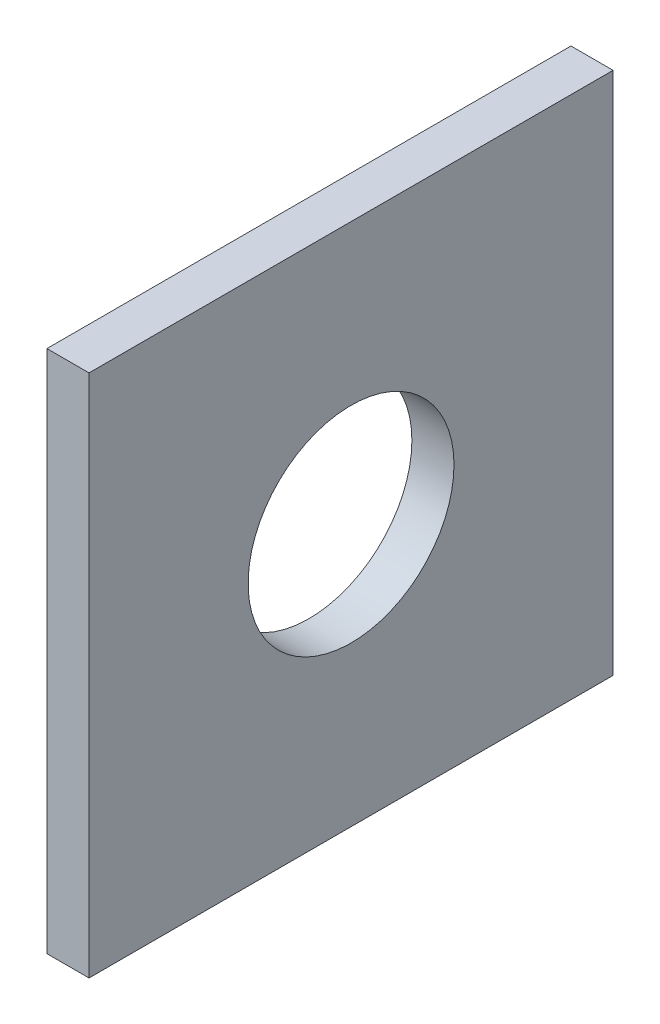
ISO-10303-21;
HEADER;
FILE_DESCRIPTION(('STEP AP214'),'2;1');
FILE_NAME('part.step','',(''),(''),'','','');
FILE_SCHEMA(('AUTOMOTIVE_DESIGN { 1 0 10303 214 1 1 1 1 }'));
ENDSEC;
DATA;
#1=APPLICATION_CONTEXT('core data for automotive mechanical design processes');
#2=APPLICATION_PROTOCOL_DEFINITION('international standard','automotive_design',2000,#1);
#3=PRODUCT_CONTEXT('',#1,'mechanical');
#4=PRODUCT('Part','Part','',(#3));
#5=PRODUCT_RELATED_PRODUCT_CATEGORY('part','',(#4));
#6=PRODUCT_DEFINITION_FORMATION('','',#4);
#7=PRODUCT_DEFINITION_CONTEXT('part definition',#1,'design');
#8=PRODUCT_DEFINITION('design','',#6,#7);
#9=PRODUCT_DEFINITION_SHAPE('','',#8);
#10=(LENGTH_UNIT() NAMED_UNIT(*) SI_UNIT(.MILLI.,.METRE.));
#11=(NAMED_UNIT(*) PLANE_ANGLE_UNIT() SI_UNIT($,.RADIAN.));
#12=(NAMED_UNIT(*) SI_UNIT($,.STERADIAN.) SOLID_ANGLE_UNIT());
#13=UNCERTAINTY_MEASURE_WITH_UNIT(LENGTH_MEASURE(1.E-05),#10,'distance_accuracy_value','');
#14=(GEOMETRIC_REPRESENTATION_CONTEXT(3) GLOBAL_UNCERTAINTY_ASSIGNED_CONTEXT((#13)) GLOBAL_UNIT_ASSIGNED_CONTEXT((#10,
#11,#12)) REPRESENTATION_CONTEXT('',''));
#15=CARTESIAN_POINT('',(0.,0.,0.));
#16=DIRECTION('',(0.,0.,1.));
#17=DIRECTION('',(1.,0.,0.));
#18=AXIS2_PLACEMENT_3D('',#15,#16,#17);
#19=CARTESIAN_POINT('',(-4.5,-28.,28.));
#20=DIRECTION('',(0.,0.,1.));
#21=DIRECTION('',(0.,-1.,0.));
#22=AXIS2_PLACEMENT_3D('',#19,#20,#21);
#23=PLANE('',#22);
#24=DIRECTION('',(0.,-1.,0.));
#25=VECTOR('',#24,1.);
#26=CARTESIAN_POINT('',(0.,-28.,28.));
#27=LINE('',#26,#25);
#28=CARTESIAN_POINT('',(0.,28.,28.));
#29=VERTEX_POINT('',#28);
#30=CARTESIAN_POINT('',(0.,-28.,28.));
#31=VERTEX_POINT('',#30);
#32=EDGE_CURVE('E104',#29,#31,#27,.T.);
#33=ORIENTED_EDGE('',*,*,#32,.F.);
#34=DIRECTION('',(1.,0.,0.));
#35=VECTOR('',#34,1.);
#36=CARTESIAN_POINT('',(-4.5,28.,28.));
#37=LINE('',#36,#35);
#38=CARTESIAN_POINT('',(-4.5,28.,28.));
#39=VERTEX_POINT('',#38);
#40=EDGE_CURVE('E11',#39,#29,#37,.T.);
#41=ORIENTED_EDGE('',*,*,#40,.F.);
#42=DIRECTION('',(0.,-1.,0.));
#43=VECTOR('',#42,1.);
#44=CARTESIAN_POINT('',(-4.5,-28.,28.));
#45=LINE('',#44,#43);
#46=CARTESIAN_POINT('',(-4.5,-28.,28.));
#47=VERTEX_POINT('',#46);
#48=EDGE_CURVE('E97',#39,#47,#45,.T.);
#49=ORIENTED_EDGE('',*,*,#48,.T.);
#50=DIRECTION('',(1.,0.,0.));
#51=VECTOR('',#50,1.);
#52=CARTESIAN_POINT('',(-4.5,-28.,28.));
#53=LINE('',#52,#51);
#54=EDGE_CURVE('E42',#47,#31,#53,.T.);
#55=ORIENTED_EDGE('',*,*,#54,.T.);
#56=EDGE_LOOP('',(#33,#41,#49,#55));
#57=FACE_BOUND('',#56,.T.);
#58=ADVANCED_FACE('F39',(#57),#23,.T.);
#59=CARTESIAN_POINT('',(-4.5,28.,28.));
#60=DIRECTION('',(0.,1.,0.));
#61=DIRECTION('',(0.,0.,1.));
#62=AXIS2_PLACEMENT_3D('',#59,#60,#61);
#63=PLANE('',#62);
#64=DIRECTION('',(0.,0.,1.));
#65=VECTOR('',#64,1.);
#66=CARTESIAN_POINT('',(0.,28.,28.));
#67=LINE('',#66,#65);
#68=CARTESIAN_POINT('',(0.,28.,-28.));
#69=VERTEX_POINT('',#68);
#70=EDGE_CURVE('E99',#69,#29,#67,.T.);
#71=ORIENTED_EDGE('',*,*,#70,.F.);
#72=DIRECTION('',(1.,0.,0.));
#73=VECTOR('',#72,1.);
#74=CARTESIAN_POINT('',(-4.5,28.,-28.));
#75=LINE('',#74,#73);
#76=CARTESIAN_POINT('',(-4.5,28.,-28.));
#77=VERTEX_POINT('',#76);
#78=EDGE_CURVE('E48',#77,#69,#75,.T.);
#79=ORIENTED_EDGE('',*,*,#78,.F.);
#80=DIRECTION('',(0.,0.,1.));
#81=VECTOR('',#80,1.);
#82=CARTESIAN_POINT('',(-4.5,28.,28.));
#83=LINE('',#82,#81);
#84=EDGE_CURVE('E94',#77,#39,#83,.T.);
#85=ORIENTED_EDGE('',*,*,#84,.T.);
#86=ORIENTED_EDGE('',*,*,#40,.T.);
#87=EDGE_LOOP('',(#71,#79,#85,#86));
#88=FACE_BOUND('',#87,.T.);
#89=ADVANCED_FACE('F115',(#88),#63,.T.);
#90=CARTESIAN_POINT('',(-4.5,-28.,-28.));
#91=DIRECTION('',(0.,0.,-1.));
#92=DIRECTION('',(0.,1.,0.));
#93=AXIS2_PLACEMENT_3D('',#90,#91,#92);
#94=PLANE('',#93);
#95=DIRECTION('',(0.,1.,0.));
#96=VECTOR('',#95,1.);
#97=CARTESIAN_POINT('',(0.,-28.,-28.));
#98=LINE('',#97,#96);
#99=CARTESIAN_POINT('',(0.,-28.,-28.));
#100=VERTEX_POINT('',#99);
#101=EDGE_CURVE('E89',#100,#69,#98,.T.);
#102=ORIENTED_EDGE('',*,*,#101,.F.);
#103=DIRECTION('',(1.,0.,0.));
#104=VECTOR('',#103,1.);
#105=CARTESIAN_POINT('',(-4.5,-28.,-28.));
#106=LINE('',#105,#104);
#107=CARTESIAN_POINT('',(-4.5,-28.,-28.));
#108=VERTEX_POINT('',#107);
#109=EDGE_CURVE('E84',#108,#100,#106,.T.);
#110=ORIENTED_EDGE('',*,*,#109,.F.);
#111=DIRECTION('',(0.,1.,0.));
#112=VECTOR('',#111,1.);
#113=CARTESIAN_POINT('',(-4.5,-28.,-28.));
#114=LINE('',#113,#112);
#115=EDGE_CURVE('E87',#108,#77,#114,.T.);
#116=ORIENTED_EDGE('',*,*,#115,.T.);
#117=ORIENTED_EDGE('',*,*,#78,.T.);
#118=EDGE_LOOP('',(#102,#110,#116,#117));
#119=FACE_BOUND('',#118,.T.);
#120=ADVANCED_FACE('F86',(#119),#94,.T.);
#121=CARTESIAN_POINT('',(-4.5,-28.,28.));
#122=DIRECTION('',(0.,-1.,0.));
#123=DIRECTION('',(0.,0.,-1.));
#124=AXIS2_PLACEMENT_3D('',#121,#122,#123);
#125=PLANE('',#124);
#126=DIRECTION('',(0.,0.,-1.));
#127=VECTOR('',#126,1.);
#128=CARTESIAN_POINT('',(0.,-28.,28.));
#129=LINE('',#128,#127);
#130=EDGE_CURVE('E107',#31,#100,#129,.T.);
#131=ORIENTED_EDGE('',*,*,#130,.F.);
#132=ORIENTED_EDGE('',*,*,#54,.F.);
#133=DIRECTION('',(0.,0.,-1.));
#134=VECTOR('',#133,1.);
#135=CARTESIAN_POINT('',(-4.5,-28.,28.));
#136=LINE('',#135,#134);
#137=EDGE_CURVE('E93',#47,#108,#136,.T.);
#138=ORIENTED_EDGE('',*,*,#137,.T.);
#139=ORIENTED_EDGE('',*,*,#109,.T.);
#140=EDGE_LOOP('',(#131,#132,#138,#139));
#141=FACE_BOUND('',#140,.T.);
#142=ADVANCED_FACE('F96',(#141),#125,.T.);
#143=CARTESIAN_POINT('',(-4.5,-28.,28.));
#144=DIRECTION('',(-1.,0.,0.));
#145=DIRECTION('',(0.,0.,1.));
#146=AXIS2_PLACEMENT_3D('',#143,#144,#145);
#147=PLANE('',#146);
#148=CARTESIAN_POINT('',(-4.5,0.,0.));
#149=DIRECTION('',(1.,0.,0.));
#150=DIRECTION('',(0.,0.,-1.));
#151=AXIS2_PLACEMENT_3D('',#148,#149,#150);
#152=CIRCLE('',#151,11.);
#153=CARTESIAN_POINT('',(-4.5,0.,-11.));
#154=VERTEX_POINT('',#153);
#155=EDGE_CURVE('E108',#154,#154,#152,.T.);
#156=ORIENTED_EDGE('',*,*,#155,.T.);
#157=EDGE_LOOP('',(#156));
#158=FACE_BOUND('',#157,.T.);
#159=ORIENTED_EDGE('',*,*,#48,.F.);
#160=ORIENTED_EDGE('',*,*,#84,.F.);
#161=ORIENTED_EDGE('',*,*,#115,.F.);
#162=ORIENTED_EDGE('',*,*,#137,.F.);
#163=EDGE_LOOP('',(#159,#160,#161,#162));
#164=FACE_BOUND('',#163,.T.);
#165=ADVANCED_FACE('F92',(#158,#164),#147,.T.);
#166=CARTESIAN_POINT('',(0.,-28.,28.));
#167=DIRECTION('',(-1.,0.,0.));
#168=DIRECTION('',(0.,0.,1.));
#169=AXIS2_PLACEMENT_3D('',#166,#167,#168);
#170=PLANE('',#169);
#171=CARTESIAN_POINT('',(0.,0.,0.));
#172=DIRECTION('',(1.,0.,0.));
#173=DIRECTION('',(0.,0.,-1.));
#174=AXIS2_PLACEMENT_3D('',#171,#172,#173);
#175=CIRCLE('',#174,11.);
#176=CARTESIAN_POINT('',(0.,0.,-11.));
#177=VERTEX_POINT('',#176);
#178=EDGE_CURVE('E145',#177,#177,#175,.T.);
#179=ORIENTED_EDGE('',*,*,#178,.F.);
#180=EDGE_LOOP('',(#179));
#181=FACE_BOUND('',#180,.T.);
#182=ORIENTED_EDGE('',*,*,#32,.T.);
#183=ORIENTED_EDGE('',*,*,#130,.T.);
#184=ORIENTED_EDGE('',*,*,#101,.T.);
#185=ORIENTED_EDGE('',*,*,#70,.T.);
#186=EDGE_LOOP('',(#182,#183,#184,#185));
#187=FACE_BOUND('',#186,.T.);
#188=ADVANCED_FACE('F114',(#181,#187),#170,.F.);
#189=CARTESIAN_POINT('',(-4.5,0.,0.));
#190=DIRECTION('',(1.,0.,0.));
#191=DIRECTION('',(0.,0.,-1.));
#192=AXIS2_PLACEMENT_3D('',#189,#190,#191);
#193=CYLINDRICAL_SURFACE('',#192,11.);
#194=ORIENTED_EDGE('',*,*,#155,.F.);
#195=EDGE_LOOP('',(#194));
#196=FACE_BOUND('',#195,.T.);
#197=ORIENTED_EDGE('',*,*,#178,.T.);
#198=EDGE_LOOP('',(#197));
#199=FACE_BOUND('',#198,.T.);
#200=ADVANCED_FACE('F133',(#196,#199),#193,.F.);
#201=CLOSED_SHELL('',(#58,#89,#120,#142,#165,#188,#200));
#202=MANIFOLD_SOLID_BREP('B2',#201);
#203=ADVANCED_BREP_SHAPE_REPRESENTATION('',(#18,#202),#14);
#204=SHAPE_DEFINITION_REPRESENTATION(#9,#203);
ENDSEC;
END-ISO-10303-21;
